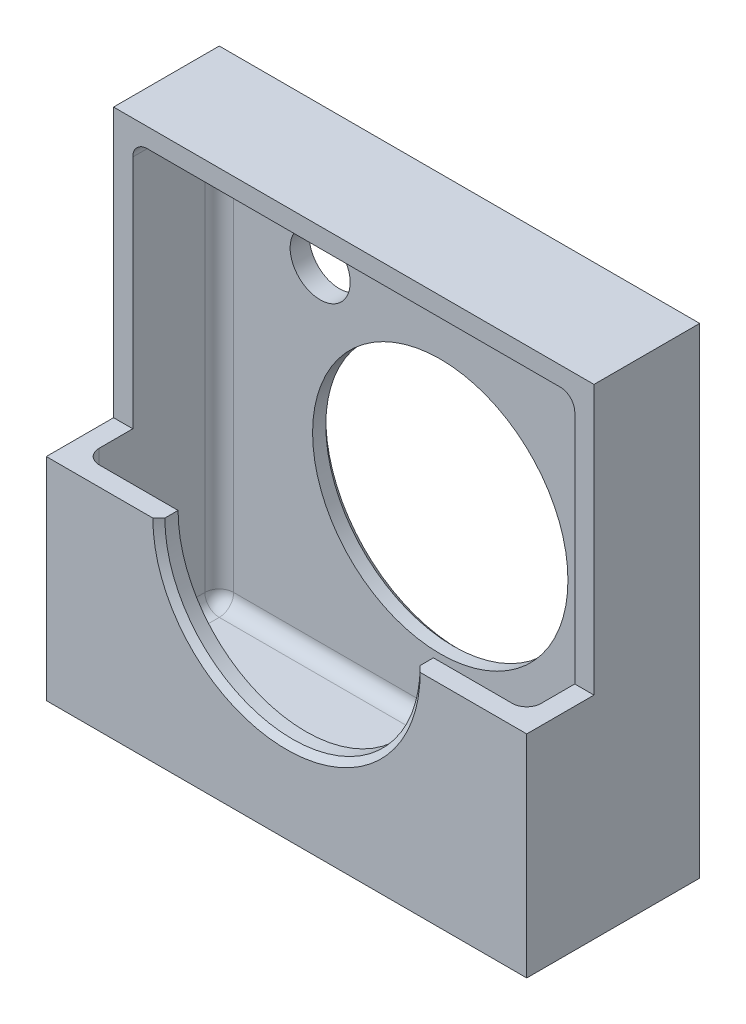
ISO-10303-21;
HEADER;
FILE_DESCRIPTION(('STEP AP214'),'2;1');
FILE_NAME('part.step','',(''),(''),'','','');
FILE_SCHEMA(('AUTOMOTIVE_DESIGN { 1 0 10303 214 1 1 1 1 }'));
ENDSEC;
DATA;
#1=APPLICATION_CONTEXT('core data for automotive mechanical design processes');
#2=APPLICATION_PROTOCOL_DEFINITION('international standard','automotive_design',2000,#1);
#3=PRODUCT_CONTEXT('',#1,'mechanical');
#4=PRODUCT('Part','Part','',(#3));
#5=PRODUCT_RELATED_PRODUCT_CATEGORY('part','',(#4));
#6=PRODUCT_DEFINITION_FORMATION('','',#4);
#7=PRODUCT_DEFINITION_CONTEXT('part definition',#1,'design');
#8=PRODUCT_DEFINITION('design','',#6,#7);
#9=PRODUCT_DEFINITION_SHAPE('','',#8);
#10=(LENGTH_UNIT() NAMED_UNIT(*) SI_UNIT(.MILLI.,.METRE.));
#11=(NAMED_UNIT(*) PLANE_ANGLE_UNIT() SI_UNIT($,.RADIAN.));
#12=(NAMED_UNIT(*) SI_UNIT($,.STERADIAN.) SOLID_ANGLE_UNIT());
#13=UNCERTAINTY_MEASURE_WITH_UNIT(LENGTH_MEASURE(1.E-05),#10,'distance_accuracy_value','');
#14=(GEOMETRIC_REPRESENTATION_CONTEXT(3) GLOBAL_UNCERTAINTY_ASSIGNED_CONTEXT((#13)) GLOBAL_UNIT_ASSIGNED_CONTEXT((#10,
#11,#12)) REPRESENTATION_CONTEXT('',''));
#15=CARTESIAN_POINT('',(0.,0.,0.));
#16=DIRECTION('',(0.,0.,1.));
#17=DIRECTION('',(1.,0.,0.));
#18=AXIS2_PLACEMENT_3D('',#15,#16,#17);
#19=CARTESIAN_POINT('',(0.,22.352,11.176));
#20=DIRECTION('',(0.,1.,0.));
#21=DIRECTION('',(0.,0.,1.));
#22=AXIS2_PLACEMENT_3D('',#19,#20,#21);
#23=PLANE('',#22);
#24=DIRECTION('',(0.,0.,-1.));
#25=VECTOR('',#24,1.);
#26=CARTESIAN_POINT('',(38.9001,22.352,18.288));
#27=LINE('',#26,#25);
#28=CARTESIAN_POINT('',(38.9001,22.352,16.256));
#29=VERTEX_POINT('',#28);
#30=CARTESIAN_POINT('',(38.9001,22.352,17.653));
#31=VERTEX_POINT('',#30);
#32=EDGE_CURVE('E247',#29,#31,#27,.F.);
#33=ORIENTED_EDGE('',*,*,#32,.T.);
#34=DIRECTION('',(-0.707106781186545,0.,-0.70710678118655));
#35=VECTOR('',#34,1.);
#36=CARTESIAN_POINT('',(25.4,22.352,4.15289999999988));
#37=LINE('',#36,#35);
#38=CARTESIAN_POINT('',(39.5351,22.352,18.288));
#39=VERTEX_POINT('',#38);
#40=EDGE_CURVE('E428',#31,#39,#37,.F.);
#41=ORIENTED_EDGE('',*,*,#40,.T.);
#42=DIRECTION('',(1.,0.,0.));
#43=VECTOR('',#42,1.);
#44=CARTESIAN_POINT('',(0.,22.352,18.288));
#45=LINE('',#44,#43);
#46=CARTESIAN_POINT('',(50.8,22.352,18.288));
#47=VERTEX_POINT('',#46);
#48=EDGE_CURVE('E276',#39,#47,#45,.T.);
#49=ORIENTED_EDGE('',*,*,#48,.T.);
#50=DIRECTION('',(0.,0.,1.));
#51=VECTOR('',#50,1.);
#52=CARTESIAN_POINT('',(50.8,22.352,11.176));
#53=LINE('',#52,#51);
#54=CARTESIAN_POINT('',(50.8,22.352,11.176));
#55=VERTEX_POINT('',#54);
#56=EDGE_CURVE('E264',#55,#47,#53,.T.);
#57=ORIENTED_EDGE('',*,*,#56,.F.);
#58=DIRECTION('',(1.,0.,0.));
#59=VECTOR('',#58,1.);
#60=CARTESIAN_POINT('',(0.,22.352,11.176));
#61=LINE('',#60,#59);
#62=CARTESIAN_POINT('',(48.768,22.352,11.176));
#63=VERTEX_POINT('',#62);
#64=EDGE_CURVE('E287',#63,#55,#61,.T.);
#65=ORIENTED_EDGE('',*,*,#64,.F.);
#66=DIRECTION('',(0.,0.,1.));
#67=VECTOR('',#66,1.);
#68=CARTESIAN_POINT('',(48.768,22.352,18.288));
#69=LINE('',#68,#67);
#70=CARTESIAN_POINT('',(48.768,22.352,14.732));
#71=VERTEX_POINT('',#70);
#72=EDGE_CURVE('E250',#63,#71,#69,.T.);
#73=ORIENTED_EDGE('',*,*,#72,.T.);
#74=CARTESIAN_POINT('',(47.244,22.352,14.732));
#75=DIRECTION('',(0.,1.,0.));
#76=DIRECTION('',(0.,0.,1.));
#77=AXIS2_PLACEMENT_3D('',#74,#75,#76);
#78=CIRCLE('',#77,1.524);
#79=CARTESIAN_POINT('',(47.244,22.352,16.256));
#80=VERTEX_POINT('',#79);
#81=EDGE_CURVE('E343',#71,#80,#78,.F.);
#82=ORIENTED_EDGE('',*,*,#81,.T.);
#83=DIRECTION('',(1.,0.,0.));
#84=VECTOR('',#83,1.);
#85=CARTESIAN_POINT('',(0.,22.352,16.256));
#86=LINE('',#85,#84);
#87=EDGE_CURVE('E255',#29,#80,#86,.T.);
#88=ORIENTED_EDGE('',*,*,#87,.F.);
#89=EDGE_LOOP('',(#33,#41,#49,#57,#65,#73,#82,#88));
#90=FACE_BOUND('',#89,.T.);
#91=ADVANCED_FACE('F34',(#90),#23,.T.);
#92=CARTESIAN_POINT('',(0.,22.352,18.288));
#93=VERTEX_POINT('',#92);
#94=CARTESIAN_POINT('',(11.2649,22.352,18.288));
#95=VERTEX_POINT('',#94);
#96=EDGE_CURVE('E288',#93,#95,#45,.T.);
#97=ORIENTED_EDGE('',*,*,#96,.T.);
#98=DIRECTION('',(-0.707106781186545,0.,0.70710678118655));
#99=VECTOR('',#98,1.);
#100=CARTESIAN_POINT('',(25.4,22.352,4.15289999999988));
#101=LINE('',#100,#99);
#102=CARTESIAN_POINT('',(11.8999,22.352,17.653));
#103=VERTEX_POINT('',#102);
#104=EDGE_CURVE('E432',#95,#103,#101,.F.);
#105=ORIENTED_EDGE('',*,*,#104,.T.);
#106=DIRECTION('',(0.,0.,-1.));
#107=VECTOR('',#106,1.);
#108=CARTESIAN_POINT('',(11.8999,22.352,18.288));
#109=LINE('',#108,#107);
#110=CARTESIAN_POINT('',(11.8999,22.352,16.256));
#111=VERTEX_POINT('',#110);
#112=EDGE_CURVE('E244',#103,#111,#109,.T.);
#113=ORIENTED_EDGE('',*,*,#112,.T.);
#114=CARTESIAN_POINT('',(3.556,22.352,16.256));
#115=VERTEX_POINT('',#114);
#116=EDGE_CURVE('E251',#115,#111,#86,.T.);
#117=ORIENTED_EDGE('',*,*,#116,.F.);
#118=CARTESIAN_POINT('',(3.556,22.352,14.732));
#119=DIRECTION('',(0.,1.,0.));
#120=DIRECTION('',(0.,0.,1.));
#121=AXIS2_PLACEMENT_3D('',#118,#119,#120);
#122=CIRCLE('',#121,1.524);
#123=CARTESIAN_POINT('',(2.032,22.352,14.732));
#124=VERTEX_POINT('',#123);
#125=EDGE_CURVE('E345',#115,#124,#122,.F.);
#126=ORIENTED_EDGE('',*,*,#125,.T.);
#127=DIRECTION('',(0.,0.,1.));
#128=VECTOR('',#127,1.);
#129=CARTESIAN_POINT('',(2.032,22.352,11.176));
#130=LINE('',#129,#128);
#131=CARTESIAN_POINT('',(2.032,22.352,11.176));
#132=VERTEX_POINT('',#131);
#133=EDGE_CURVE('E261',#132,#124,#130,.T.);
#134=ORIENTED_EDGE('',*,*,#133,.F.);
#135=CARTESIAN_POINT('',(0.,22.352,11.176));
#136=VERTEX_POINT('',#135);
#137=EDGE_CURVE('E284',#136,#132,#61,.T.);
#138=ORIENTED_EDGE('',*,*,#137,.F.);
#139=DIRECTION('',(0.,0.,1.));
#140=VECTOR('',#139,1.);
#141=CARTESIAN_POINT('',(0.,22.352,11.176));
#142=LINE('',#141,#140);
#143=EDGE_CURVE('E270',#136,#93,#142,.T.);
#144=ORIENTED_EDGE('',*,*,#143,.T.);
#145=EDGE_LOOP('',(#97,#105,#113,#117,#126,#134,#138,#144));
#146=FACE_BOUND('',#145,.T.);
#147=ADVANCED_FACE('F463',(#146),#23,.T.);
#148=CARTESIAN_POINT('',(0.,50.8,18.288));
#149=DIRECTION('',(0.,0.,1.));
#150=DIRECTION('',(1.,0.,0.));
#151=AXIS2_PLACEMENT_3D('',#148,#149,#150);
#152=PLANE('',#151);
#153=ORIENTED_EDGE('',*,*,#48,.F.);
#154=CARTESIAN_POINT('',(25.4,22.352,18.288));
#155=DIRECTION('',(0.,0.,1.));
#156=DIRECTION('',(1.,0.,0.));
#157=AXIS2_PLACEMENT_3D('',#154,#155,#156);
#158=CIRCLE('',#157,14.1351);
#159=EDGE_CURVE('E430',#39,#95,#158,.F.);
#160=ORIENTED_EDGE('',*,*,#159,.T.);
#161=ORIENTED_EDGE('',*,*,#96,.F.);
#162=DIRECTION('',(0.,1.,0.));
#163=VECTOR('',#162,1.);
#164=CARTESIAN_POINT('',(0.,0.,18.288));
#165=LINE('',#164,#163);
#166=CARTESIAN_POINT('',(0.,0.,18.288));
#167=VERTEX_POINT('',#166);
#168=EDGE_CURVE('E291',#167,#93,#165,.T.);
#169=ORIENTED_EDGE('',*,*,#168,.F.);
#170=DIRECTION('',(1.,0.,0.));
#171=VECTOR('',#170,1.);
#172=CARTESIAN_POINT('',(0.,0.,18.288));
#173=LINE('',#172,#171);
#174=CARTESIAN_POINT('',(50.8,0.,18.288));
#175=VERTEX_POINT('',#174);
#176=EDGE_CURVE('E297',#167,#175,#173,.T.);
#177=ORIENTED_EDGE('',*,*,#176,.T.);
#178=DIRECTION('',(0.,-1.,0.));
#179=VECTOR('',#178,1.);
#180=CARTESIAN_POINT('',(50.8,50.8,18.288));
#181=LINE('',#180,#179);
#182=EDGE_CURVE('E294',#47,#175,#181,.T.);
#183=ORIENTED_EDGE('',*,*,#182,.F.);
#184=EDGE_LOOP('',(#153,#160,#161,#169,#177,#183));
#185=FACE_BOUND('',#184,.T.);
#186=ADVANCED_FACE('F469',(#185),#152,.T.);
#187=CARTESIAN_POINT('',(0.,50.8,0.));
#188=DIRECTION('',(0.,0.,1.));
#189=DIRECTION('',(1.,0.,0.));
#190=AXIS2_PLACEMENT_3D('',#187,#188,#189);
#191=PLANE('',#190);
#192=DIRECTION('',(0.,-1.,0.));
#193=VECTOR('',#192,1.);
#194=CARTESIAN_POINT('',(11.811,42.545,5.6843418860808E-11));
#195=LINE('',#194,#193);
#196=CARTESIAN_POINT('',(11.811,42.545,5.6843418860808E-11));
#197=VERTEX_POINT('',#196);
#198=CARTESIAN_POINT('',(11.811,41.148,0.));
#199=VERTEX_POINT('',#198);
#200=EDGE_CURVE('E224',#197,#199,#195,.T.);
#201=ORIENTED_EDGE('',*,*,#200,.T.);
#202=CARTESIAN_POINT('',(12.7,38.1,5.6843418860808E-11));
#203=DIRECTION('',(0.,0.,-1.));
#204=DIRECTION('',(-1.,0.,0.));
#205=AXIS2_PLACEMENT_3D('',#202,#203,#204);
#206=CIRCLE('',#205,3.17499999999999);
#207=CARTESIAN_POINT('',(13.589,41.148,5.6843418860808E-11));
#208=VERTEX_POINT('',#207);
#209=EDGE_CURVE('E49',#208,#199,#206,.T.);
#210=ORIENTED_EDGE('',*,*,#209,.F.);
#211=DIRECTION('',(0.,1.,0.));
#212=VECTOR('',#211,1.);
#213=CARTESIAN_POINT('',(13.589,41.148,5.6843418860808E-11));
#214=LINE('',#213,#212);
#215=CARTESIAN_POINT('',(13.589,42.545,5.6843418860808E-11));
#216=VERTEX_POINT('',#215);
#217=EDGE_CURVE('E231',#208,#216,#214,.T.);
#218=ORIENTED_EDGE('',*,*,#217,.T.);
#219=DIRECTION('',(1.,0.,0.));
#220=VECTOR('',#219,1.);
#221=CARTESIAN_POINT('',(11.811,42.545,5.6843418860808E-11));
#222=LINE('',#221,#220);
#223=EDGE_CURVE('E215',#197,#216,#222,.T.);
#224=ORIENTED_EDGE('',*,*,#223,.F.);
#225=EDGE_LOOP('',(#201,#210,#218,#224));
#226=FACE_BOUND('',#225,.T.);
#227=CARTESIAN_POINT('',(25.4,22.352,0.));
#228=DIRECTION('',(0.,0.,1.));
#229=DIRECTION('',(1.,0.,0.));
#230=AXIS2_PLACEMENT_3D('',#227,#228,#229);
#231=CIRCLE('',#230,14.1351);
#232=CARTESIAN_POINT('',(39.5351,22.352,0.));
#233=VERTEX_POINT('',#232);
#234=EDGE_CURVE('E434',#233,#233,#231,.T.);
#235=ORIENTED_EDGE('',*,*,#234,.T.);
#236=EDGE_LOOP('',(#235));
#237=FACE_BOUND('',#236,.T.);
#238=DIRECTION('',(0.,1.,0.));
#239=VECTOR('',#238,1.);
#240=CARTESIAN_POINT('',(0.,0.,0.));
#241=LINE('',#240,#239);
#242=CARTESIAN_POINT('',(0.,0.,0.));
#243=VERTEX_POINT('',#242);
#244=CARTESIAN_POINT('',(0.,50.8,0.));
#245=VERTEX_POINT('',#244);
#246=EDGE_CURVE('E283',#243,#245,#241,.T.);
#247=ORIENTED_EDGE('',*,*,#246,.T.);
#248=DIRECTION('',(-1.,0.,0.));
#249=VECTOR('',#248,1.);
#250=CARTESIAN_POINT('',(50.8,50.8,0.));
#251=LINE('',#250,#249);
#252=CARTESIAN_POINT('',(50.8,50.8,0.));
#253=VERTEX_POINT('',#252);
#254=EDGE_CURVE('E303',#253,#245,#251,.T.);
#255=ORIENTED_EDGE('',*,*,#254,.F.);
#256=DIRECTION('',(0.,-1.,0.));
#257=VECTOR('',#256,1.);
#258=CARTESIAN_POINT('',(50.8,50.8,0.));
#259=LINE('',#258,#257);
#260=CARTESIAN_POINT('',(50.8,0.,0.));
#261=VERTEX_POINT('',#260);
#262=EDGE_CURVE('E306',#253,#261,#259,.T.);
#263=ORIENTED_EDGE('',*,*,#262,.T.);
#264=DIRECTION('',(1.,0.,0.));
#265=VECTOR('',#264,1.);
#266=CARTESIAN_POINT('',(0.,0.,0.));
#267=LINE('',#266,#265);
#268=EDGE_CURVE('E295',#243,#261,#267,.T.);
#269=ORIENTED_EDGE('',*,*,#268,.F.);
#270=EDGE_LOOP('',(#247,#255,#263,#269));
#271=FACE_BOUND('',#270,.T.);
#272=ADVANCED_FACE('F228',(#226,#237,#271),#191,.F.);
#273=CARTESIAN_POINT('',(0.,50.8,16.256));
#274=DIRECTION('',(0.,0.,1.));
#275=DIRECTION('',(1.,0.,0.));
#276=AXIS2_PLACEMENT_3D('',#273,#274,#275);
#277=PLANE('',#276);
#278=DIRECTION('',(0.,-1.,0.));
#279=VECTOR('',#278,1.);
#280=CARTESIAN_POINT('',(47.244,2.032,16.256));
#281=LINE('',#280,#279);
#282=CARTESIAN_POINT('',(47.244,3.556,16.256));
#283=VERTEX_POINT('',#282);
#284=EDGE_CURVE('E323',#80,#283,#281,.T.);
#285=ORIENTED_EDGE('',*,*,#284,.T.);
#286=DIRECTION('',(1.,0.,0.));
#287=VECTOR('',#286,1.);
#288=CARTESIAN_POINT('',(0.,3.556,16.256));
#289=LINE('',#288,#287);
#290=CARTESIAN_POINT('',(3.556,3.556,16.256));
#291=VERTEX_POINT('',#290);
#292=EDGE_CURVE('E388',#283,#291,#289,.F.);
#293=ORIENTED_EDGE('',*,*,#292,.T.);
#294=DIRECTION('',(0.,1.,0.));
#295=VECTOR('',#294,1.);
#296=CARTESIAN_POINT('',(3.556,22.352,16.256));
#297=LINE('',#296,#295);
#298=EDGE_CURVE('E313',#291,#115,#297,.T.);
#299=ORIENTED_EDGE('',*,*,#298,.T.);
#300=ORIENTED_EDGE('',*,*,#116,.T.);
#301=CARTESIAN_POINT('',(25.4,22.352,16.256));
#302=DIRECTION('',(0.,0.,1.));
#303=DIRECTION('',(1.,0.,0.));
#304=AXIS2_PLACEMENT_3D('',#301,#302,#303);
#305=CIRCLE('',#304,13.5001);
#306=EDGE_CURVE('E241',#29,#111,#305,.F.);
#307=ORIENTED_EDGE('',*,*,#306,.F.);
#308=ORIENTED_EDGE('',*,*,#87,.T.);
#309=EDGE_LOOP('',(#285,#293,#299,#300,#307,#308));
#310=FACE_BOUND('',#309,.T.);
#311=ADVANCED_FACE('F480',(#310),#277,.F.);
#312=CARTESIAN_POINT('',(0.,50.8,2.032));
#313=DIRECTION('',(0.,0.,1.));
#314=DIRECTION('',(1.,0.,0.));
#315=AXIS2_PLACEMENT_3D('',#312,#313,#314);
#316=PLANE('',#315);
#317=CARTESIAN_POINT('',(12.7,38.1,2.032));
#318=DIRECTION('',(0.,0.,1.));
#319=DIRECTION('',(1.,0.,0.));
#320=AXIS2_PLACEMENT_3D('',#317,#318,#319);
#321=CIRCLE('',#320,3.17499999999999);
#322=CARTESIAN_POINT('',(11.811,41.148,2.032));
#323=VERTEX_POINT('',#322);
#324=CARTESIAN_POINT('',(13.589,41.148,2.032));
#325=VERTEX_POINT('',#324);
#326=EDGE_CURVE('E11',#323,#325,#321,.T.);
#327=ORIENTED_EDGE('',*,*,#326,.F.);
#328=DIRECTION('',(0.,1.,0.));
#329=VECTOR('',#328,1.);
#330=CARTESIAN_POINT('',(11.811,50.8,2.032));
#331=LINE('',#330,#329);
#332=CARTESIAN_POINT('',(11.811,42.545,2.032));
#333=VERTEX_POINT('',#332);
#334=EDGE_CURVE('E440',#323,#333,#331,.T.);
#335=ORIENTED_EDGE('',*,*,#334,.T.);
#336=DIRECTION('',(-1.,0.,0.));
#337=VECTOR('',#336,1.);
#338=CARTESIAN_POINT('',(0.,42.545,2.032));
#339=LINE('',#338,#337);
#340=CARTESIAN_POINT('',(13.589,42.545,2.032));
#341=VERTEX_POINT('',#340);
#342=EDGE_CURVE('E218',#341,#333,#339,.T.);
#343=ORIENTED_EDGE('',*,*,#342,.F.);
#344=DIRECTION('',(0.,-1.,0.));
#345=VECTOR('',#344,1.);
#346=CARTESIAN_POINT('',(13.589,50.8,2.032));
#347=LINE('',#346,#345);
#348=EDGE_CURVE('E42',#341,#325,#347,.T.);
#349=ORIENTED_EDGE('',*,*,#348,.T.);
#350=EDGE_LOOP('',(#327,#335,#343,#349));
#351=FACE_BOUND('',#350,.T.);
#352=DIRECTION('',(0.,1.,0.));
#353=VECTOR('',#352,1.);
#354=CARTESIAN_POINT('',(3.55600000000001,50.8,2.032));
#355=LINE('',#354,#353);
#356=CARTESIAN_POINT('',(3.55600000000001,47.244,2.032));
#357=VERTEX_POINT('',#356);
#358=CARTESIAN_POINT('',(3.556,3.556,2.032));
#359=VERTEX_POINT('',#358);
#360=EDGE_CURVE('E331',#357,#359,#355,.F.);
#361=ORIENTED_EDGE('',*,*,#360,.T.);
#362=DIRECTION('',(1.,0.,0.));
#363=VECTOR('',#362,1.);
#364=CARTESIAN_POINT('',(47.244,3.556,2.032));
#365=LINE('',#364,#363);
#366=CARTESIAN_POINT('',(47.244,3.556,2.032));
#367=VERTEX_POINT('',#366);
#368=EDGE_CURVE('E349',#359,#367,#365,.T.);
#369=ORIENTED_EDGE('',*,*,#368,.T.);
#370=DIRECTION('',(0.,-1.,0.));
#371=VECTOR('',#370,1.);
#372=CARTESIAN_POINT('',(47.244,50.8,2.032));
#373=LINE('',#372,#371);
#374=CARTESIAN_POINT('',(47.244,47.244,2.032));
#375=VERTEX_POINT('',#374);
#376=EDGE_CURVE('E334',#367,#375,#373,.F.);
#377=ORIENTED_EDGE('',*,*,#376,.T.);
#378=DIRECTION('',(-1.,0.,0.));
#379=VECTOR('',#378,1.);
#380=CARTESIAN_POINT('',(3.55600000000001,47.244,2.032));
#381=LINE('',#380,#379);
#382=EDGE_CURVE('E347',#375,#357,#381,.T.);
#383=ORIENTED_EDGE('',*,*,#382,.T.);
#384=EDGE_LOOP('',(#361,#369,#377,#383));
#385=FACE_BOUND('',#384,.T.);
#386=CARTESIAN_POINT('',(25.4,22.352,2.032));
#387=DIRECTION('',(0.,0.,1.));
#388=DIRECTION('',(1.,0.,0.));
#389=AXIS2_PLACEMENT_3D('',#386,#387,#388);
#390=CIRCLE('',#389,13.5001);
#391=CARTESIAN_POINT('',(38.9001,22.352,2.032));
#392=VERTEX_POINT('',#391);
#393=EDGE_CURVE('E245',#392,#392,#390,.F.);
#394=ORIENTED_EDGE('',*,*,#393,.T.);
#395=EDGE_LOOP('',(#394));
#396=FACE_BOUND('',#395,.T.);
#397=ADVANCED_FACE('F445',(#351,#385,#396),#316,.T.);
#398=CARTESIAN_POINT('',(0.,22.352,11.176));
#399=DIRECTION('',(0.,0.,-1.));
#400=DIRECTION('',(-1.,0.,0.));
#401=AXIS2_PLACEMENT_3D('',#398,#399,#400);
#402=PLANE('',#401);
#403=DIRECTION('',(0.,1.,0.));
#404=VECTOR('',#403,1.);
#405=CARTESIAN_POINT('',(48.768,50.8,11.176));
#406=LINE('',#405,#404);
#407=CARTESIAN_POINT('',(48.768,47.244,11.176));
#408=VERTEX_POINT('',#407);
#409=EDGE_CURVE('E258',#63,#408,#406,.T.);
#410=ORIENTED_EDGE('',*,*,#409,.F.);
#411=ORIENTED_EDGE('',*,*,#64,.T.);
#412=DIRECTION('',(0.,1.,0.));
#413=VECTOR('',#412,1.);
#414=CARTESIAN_POINT('',(50.8,22.352,11.176));
#415=LINE('',#414,#413);
#416=CARTESIAN_POINT('',(50.8,50.8,11.176));
#417=VERTEX_POINT('',#416);
#418=EDGE_CURVE('E273',#55,#417,#415,.T.);
#419=ORIENTED_EDGE('',*,*,#418,.T.);
#420=DIRECTION('',(1.,0.,0.));
#421=VECTOR('',#420,1.);
#422=CARTESIAN_POINT('',(0.,50.8,11.176));
#423=LINE('',#422,#421);
#424=CARTESIAN_POINT('',(0.,50.8,11.176));
#425=VERTEX_POINT('',#424);
#426=EDGE_CURVE('E280',#425,#417,#423,.T.);
#427=ORIENTED_EDGE('',*,*,#426,.F.);
#428=DIRECTION('',(0.,1.,0.));
#429=VECTOR('',#428,1.);
#430=CARTESIAN_POINT('',(0.,22.352,11.176));
#431=LINE('',#430,#429);
#432=EDGE_CURVE('E272',#136,#425,#431,.T.);
#433=ORIENTED_EDGE('',*,*,#432,.F.);
#434=ORIENTED_EDGE('',*,*,#137,.T.);
#435=DIRECTION('',(0.,1.,0.));
#436=VECTOR('',#435,1.);
#437=CARTESIAN_POINT('',(2.032,22.352,11.176));
#438=LINE('',#437,#436);
#439=CARTESIAN_POINT('',(2.03200000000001,47.244,11.176));
#440=VERTEX_POINT('',#439);
#441=EDGE_CURVE('E265',#132,#440,#438,.T.);
#442=ORIENTED_EDGE('',*,*,#441,.T.);
#443=CARTESIAN_POINT('',(3.55600000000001,47.244,11.176));
#444=DIRECTION('',(0.,0.,-1.));
#445=DIRECTION('',(-1.,0.,0.));
#446=AXIS2_PLACEMENT_3D('',#443,#444,#445);
#447=CIRCLE('',#446,1.524);
#448=CARTESIAN_POINT('',(3.55600000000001,48.768,11.176));
#449=VERTEX_POINT('',#448);
#450=EDGE_CURVE('E392',#440,#449,#447,.T.);
#451=ORIENTED_EDGE('',*,*,#450,.T.);
#452=DIRECTION('',(1.,0.,0.));
#453=VECTOR('',#452,1.);
#454=CARTESIAN_POINT('',(50.8,48.768,11.176));
#455=LINE('',#454,#453);
#456=CARTESIAN_POINT('',(47.244,48.768,11.176));
#457=VERTEX_POINT('',#456);
#458=EDGE_CURVE('E254',#449,#457,#455,.T.);
#459=ORIENTED_EDGE('',*,*,#458,.T.);
#460=CARTESIAN_POINT('',(47.244,47.244,11.176));
#461=DIRECTION('',(0.,0.,-1.));
#462=DIRECTION('',(-1.,0.,0.));
#463=AXIS2_PLACEMENT_3D('',#460,#461,#462);
#464=CIRCLE('',#463,1.524);
#465=EDGE_CURVE('E390',#457,#408,#464,.T.);
#466=ORIENTED_EDGE('',*,*,#465,.T.);
#467=EDGE_LOOP('',(#410,#411,#419,#427,#433,#434,#442,#451,#459,#466));
#468=FACE_BOUND('',#467,.T.);
#469=ADVANCED_FACE('F473',(#468),#402,.F.);
#470=CARTESIAN_POINT('',(0.,0.,18.288));
#471=DIRECTION('',(-1.,0.,0.));
#472=DIRECTION('',(0.,-1.,0.));
#473=AXIS2_PLACEMENT_3D('',#470,#471,#472);
#474=PLANE('',#473);
#475=ORIENTED_EDGE('',*,*,#432,.T.);
#476=DIRECTION('',(0.,0.,-1.));
#477=VECTOR('',#476,1.);
#478=CARTESIAN_POINT('',(0.,50.8,18.288));
#479=LINE('',#478,#477);
#480=EDGE_CURVE('E300',#425,#245,#479,.T.);
#481=ORIENTED_EDGE('',*,*,#480,.T.);
#482=ORIENTED_EDGE('',*,*,#246,.F.);
#483=DIRECTION('',(0.,0.,-1.));
#484=VECTOR('',#483,1.);
#485=CARTESIAN_POINT('',(0.,0.,18.288));
#486=LINE('',#485,#484);
#487=EDGE_CURVE('E311',#167,#243,#486,.T.);
#488=ORIENTED_EDGE('',*,*,#487,.F.);
#489=ORIENTED_EDGE('',*,*,#168,.T.);
#490=ORIENTED_EDGE('',*,*,#143,.F.);
#491=EDGE_LOOP('',(#475,#481,#482,#488,#489,#490));
#492=FACE_BOUND('',#491,.T.);
#493=ADVANCED_FACE('F485',(#492),#474,.T.);
#494=CARTESIAN_POINT('',(0.,0.,18.288));
#495=DIRECTION('',(0.,1.,0.));
#496=DIRECTION('',(0.,0.,1.));
#497=AXIS2_PLACEMENT_3D('',#494,#495,#496);
#498=PLANE('',#497);
#499=ORIENTED_EDGE('',*,*,#268,.T.);
#500=DIRECTION('',(0.,0.,-1.));
#501=VECTOR('',#500,1.);
#502=CARTESIAN_POINT('',(50.8,0.,18.288));
#503=LINE('',#502,#501);
#504=EDGE_CURVE('E314',#175,#261,#503,.T.);
#505=ORIENTED_EDGE('',*,*,#504,.F.);
#506=ORIENTED_EDGE('',*,*,#176,.F.);
#507=ORIENTED_EDGE('',*,*,#487,.T.);
#508=EDGE_LOOP('',(#499,#505,#506,#507));
#509=FACE_BOUND('',#508,.T.);
#510=ADVANCED_FACE('F481',(#509),#498,.F.);
#511=CARTESIAN_POINT('',(50.8,50.8,18.288));
#512=DIRECTION('',(1.,0.,0.));
#513=DIRECTION('',(0.,1.,0.));
#514=AXIS2_PLACEMENT_3D('',#511,#512,#513);
#515=PLANE('',#514);
#516=ORIENTED_EDGE('',*,*,#418,.F.);
#517=ORIENTED_EDGE('',*,*,#56,.T.);
#518=ORIENTED_EDGE('',*,*,#182,.T.);
#519=ORIENTED_EDGE('',*,*,#504,.T.);
#520=ORIENTED_EDGE('',*,*,#262,.F.);
#521=DIRECTION('',(0.,0.,-1.));
#522=VECTOR('',#521,1.);
#523=CARTESIAN_POINT('',(50.8,50.8,18.288));
#524=LINE('',#523,#522);
#525=EDGE_CURVE('E316',#417,#253,#524,.T.);
#526=ORIENTED_EDGE('',*,*,#525,.F.);
#527=EDGE_LOOP('',(#516,#517,#518,#519,#520,#526));
#528=FACE_BOUND('',#527,.T.);
#529=ADVANCED_FACE('F484',(#528),#515,.T.);
#530=CARTESIAN_POINT('',(50.8,50.8,18.288));
#531=DIRECTION('',(0.,-1.,0.));
#532=DIRECTION('',(0.,0.,-1.));
#533=AXIS2_PLACEMENT_3D('',#530,#531,#532);
#534=PLANE('',#533);
#535=ORIENTED_EDGE('',*,*,#480,.F.);
#536=ORIENTED_EDGE('',*,*,#426,.T.);
#537=ORIENTED_EDGE('',*,*,#525,.T.);
#538=ORIENTED_EDGE('',*,*,#254,.T.);
#539=EDGE_LOOP('',(#535,#536,#537,#538));
#540=FACE_BOUND('',#539,.T.);
#541=ADVANCED_FACE('F489',(#540),#534,.F.);
#542=CARTESIAN_POINT('',(2.032,0.,18.288));
#543=DIRECTION('',(-1.,0.,0.));
#544=DIRECTION('',(0.,-1.,0.));
#545=AXIS2_PLACEMENT_3D('',#542,#543,#544);
#546=PLANE('',#545);
#547=DIRECTION('',(0.,1.,0.));
#548=VECTOR('',#547,1.);
#549=CARTESIAN_POINT('',(2.032,0.,3.556));
#550=LINE('',#549,#548);
#551=CARTESIAN_POINT('',(2.032,3.556,3.556));
#552=VERTEX_POINT('',#551);
#553=CARTESIAN_POINT('',(2.03200000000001,47.244,3.556));
#554=VERTEX_POINT('',#553);
#555=EDGE_CURVE('E340',#552,#554,#550,.T.);
#556=ORIENTED_EDGE('',*,*,#555,.T.);
#557=DIRECTION('',(0.,0.,-1.));
#558=VECTOR('',#557,1.);
#559=CARTESIAN_POINT('',(2.03200000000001,47.244,18.288));
#560=LINE('',#559,#558);
#561=EDGE_CURVE('E382',#554,#440,#560,.F.);
#562=ORIENTED_EDGE('',*,*,#561,.T.);
#563=ORIENTED_EDGE('',*,*,#441,.F.);
#564=ORIENTED_EDGE('',*,*,#133,.T.);
#565=DIRECTION('',(0.,1.,0.));
#566=VECTOR('',#565,1.);
#567=CARTESIAN_POINT('',(2.032,2.032,14.732));
#568=LINE('',#567,#566);
#569=CARTESIAN_POINT('',(2.032,3.556,14.732));
#570=VERTEX_POINT('',#569);
#571=EDGE_CURVE('E337',#124,#570,#568,.F.);
#572=ORIENTED_EDGE('',*,*,#571,.T.);
#573=DIRECTION('',(0.,0.,-1.));
#574=VECTOR('',#573,1.);
#575=CARTESIAN_POINT('',(2.032,3.556,18.288));
#576=LINE('',#575,#574);
#577=EDGE_CURVE('E380',#570,#552,#576,.T.);
#578=ORIENTED_EDGE('',*,*,#577,.T.);
#579=EDGE_LOOP('',(#556,#562,#563,#564,#572,#578));
#580=FACE_BOUND('',#579,.T.);
#581=ADVANCED_FACE('F493',(#580),#546,.F.);
#582=CARTESIAN_POINT('',(0.,2.032,18.288));
#583=DIRECTION('',(0.,1.,0.));
#584=DIRECTION('',(0.,0.,1.));
#585=AXIS2_PLACEMENT_3D('',#582,#583,#584);
#586=PLANE('',#585);
#587=DIRECTION('',(0.,0.,-1.));
#588=VECTOR('',#587,1.);
#589=CARTESIAN_POINT('',(47.244,2.032,18.288));
#590=LINE('',#589,#588);
#591=CARTESIAN_POINT('',(47.244,2.032,14.732));
#592=VERTEX_POINT('',#591);
#593=CARTESIAN_POINT('',(47.244,2.032,3.556));
#594=VERTEX_POINT('',#593);
#595=EDGE_CURVE('E354',#592,#594,#590,.T.);
#596=ORIENTED_EDGE('',*,*,#595,.T.);
#597=DIRECTION('',(1.,0.,0.));
#598=VECTOR('',#597,1.);
#599=CARTESIAN_POINT('',(3.556,2.032,3.556));
#600=LINE('',#599,#598);
#601=CARTESIAN_POINT('',(3.556,2.032,3.556));
#602=VERTEX_POINT('',#601);
#603=EDGE_CURVE('E358',#594,#602,#600,.F.);
#604=ORIENTED_EDGE('',*,*,#603,.T.);
#605=DIRECTION('',(0.,0.,-1.));
#606=VECTOR('',#605,1.);
#607=CARTESIAN_POINT('',(3.556,2.032,18.288));
#608=LINE('',#607,#606);
#609=CARTESIAN_POINT('',(3.556,2.032,14.732));
#610=VERTEX_POINT('',#609);
#611=EDGE_CURVE('E356',#602,#610,#608,.F.);
#612=ORIENTED_EDGE('',*,*,#611,.T.);
#613=DIRECTION('',(1.,0.,0.));
#614=VECTOR('',#613,1.);
#615=CARTESIAN_POINT('',(0.,2.032,14.732));
#616=LINE('',#615,#614);
#617=EDGE_CURVE('E352',#610,#592,#616,.T.);
#618=ORIENTED_EDGE('',*,*,#617,.T.);
#619=EDGE_LOOP('',(#596,#604,#612,#618));
#620=FACE_BOUND('',#619,.T.);
#621=ADVANCED_FACE('F598',(#620),#586,.T.);
#622=CARTESIAN_POINT('',(48.768,50.8,18.288));
#623=DIRECTION('',(1.,0.,0.));
#624=DIRECTION('',(0.,1.,0.));
#625=AXIS2_PLACEMENT_3D('',#622,#623,#624);
#626=PLANE('',#625);
#627=ORIENTED_EDGE('',*,*,#409,.T.);
#628=DIRECTION('',(0.,0.,-1.));
#629=VECTOR('',#628,1.);
#630=CARTESIAN_POINT('',(48.768,47.244,18.288));
#631=LINE('',#630,#629);
#632=CARTESIAN_POINT('',(48.768,47.244,3.556));
#633=VERTEX_POINT('',#632);
#634=EDGE_CURVE('E371',#408,#633,#631,.T.);
#635=ORIENTED_EDGE('',*,*,#634,.T.);
#636=DIRECTION('',(0.,-1.,0.));
#637=VECTOR('',#636,1.);
#638=CARTESIAN_POINT('',(48.768,50.8,3.556));
#639=LINE('',#638,#637);
#640=CARTESIAN_POINT('',(48.768,3.556,3.556));
#641=VERTEX_POINT('',#640);
#642=EDGE_CURVE('E326',#633,#641,#639,.T.);
#643=ORIENTED_EDGE('',*,*,#642,.T.);
#644=DIRECTION('',(0.,0.,-1.));
#645=VECTOR('',#644,1.);
#646=CARTESIAN_POINT('',(48.768,3.556,18.288));
#647=LINE('',#646,#645);
#648=CARTESIAN_POINT('',(48.768,3.556,14.732));
#649=VERTEX_POINT('',#648);
#650=EDGE_CURVE('E369',#641,#649,#647,.F.);
#651=ORIENTED_EDGE('',*,*,#650,.T.);
#652=DIRECTION('',(0.,-1.,0.));
#653=VECTOR('',#652,1.);
#654=CARTESIAN_POINT('',(48.768,22.352,14.732));
#655=LINE('',#654,#653);
#656=EDGE_CURVE('E329',#649,#71,#655,.F.);
#657=ORIENTED_EDGE('',*,*,#656,.T.);
#658=ORIENTED_EDGE('',*,*,#72,.F.);
#659=EDGE_LOOP('',(#627,#635,#643,#651,#657,#658));
#660=FACE_BOUND('',#659,.T.);
#661=ADVANCED_FACE('F641',(#660),#626,.F.);
#662=CARTESIAN_POINT('',(50.8,48.768,18.288));
#663=DIRECTION('',(0.,-1.,0.));
#664=DIRECTION('',(0.,0.,-1.));
#665=AXIS2_PLACEMENT_3D('',#662,#663,#664);
#666=PLANE('',#665);
#667=DIRECTION('',(-1.,0.,0.));
#668=VECTOR('',#667,1.);
#669=CARTESIAN_POINT('',(47.244,48.768,3.556));
#670=LINE('',#669,#668);
#671=CARTESIAN_POINT('',(3.55600000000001,48.768,3.556));
#672=VERTEX_POINT('',#671);
#673=CARTESIAN_POINT('',(47.244,48.768,3.556));
#674=VERTEX_POINT('',#673);
#675=EDGE_CURVE('E374',#672,#674,#670,.F.);
#676=ORIENTED_EDGE('',*,*,#675,.T.);
#677=DIRECTION('',(0.,0.,-1.));
#678=VECTOR('',#677,1.);
#679=CARTESIAN_POINT('',(47.244,48.768,18.288));
#680=LINE('',#679,#678);
#681=EDGE_CURVE('E378',#674,#457,#680,.F.);
#682=ORIENTED_EDGE('',*,*,#681,.T.);
#683=ORIENTED_EDGE('',*,*,#458,.F.);
#684=DIRECTION('',(0.,0.,-1.));
#685=VECTOR('',#684,1.);
#686=CARTESIAN_POINT('',(3.55600000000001,48.768,18.288));
#687=LINE('',#686,#685);
#688=EDGE_CURVE('E376',#449,#672,#687,.T.);
#689=ORIENTED_EDGE('',*,*,#688,.T.);
#690=EDGE_LOOP('',(#676,#682,#683,#689));
#691=FACE_BOUND('',#690,.T.);
#692=ADVANCED_FACE('F617',(#691),#666,.T.);
#693=CARTESIAN_POINT('',(25.4,22.352,18.288));
#694=DIRECTION('',(0.,0.,-1.));
#695=DIRECTION('',(-1.,0.,0.));
#696=AXIS2_PLACEMENT_3D('',#693,#694,#695);
#697=CYLINDRICAL_SURFACE('',#696,13.5001);
#698=CARTESIAN_POINT('',(25.4,22.352,0.635000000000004));
#699=DIRECTION('',(0.,0.,1.));
#700=DIRECTION('',(1.,0.,0.));
#701=AXIS2_PLACEMENT_3D('',#698,#699,#700);
#702=CIRCLE('',#701,13.5001);
#703=CARTESIAN_POINT('',(38.9001,22.352,0.635000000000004));
#704=VERTEX_POINT('',#703);
#705=EDGE_CURVE('E437',#704,#704,#702,.F.);
#706=ORIENTED_EDGE('',*,*,#705,.T.);
#707=EDGE_LOOP('',(#706));
#708=FACE_BOUND('',#707,.T.);
#709=ORIENTED_EDGE('',*,*,#393,.F.);
#710=EDGE_LOOP('',(#709));
#711=FACE_BOUND('',#710,.T.);
#712=ADVANCED_FACE('F654',(#708,#711),#697,.F.);
#713=ORIENTED_EDGE('',*,*,#112,.F.);
#714=CARTESIAN_POINT('',(25.4,22.352,17.653));
#715=DIRECTION('',(0.,0.,1.));
#716=DIRECTION('',(1.,0.,0.));
#717=AXIS2_PLACEMENT_3D('',#714,#715,#716);
#718=CIRCLE('',#717,13.5001);
#719=EDGE_CURVE('E394',#103,#31,#718,.T.);
#720=ORIENTED_EDGE('',*,*,#719,.T.);
#721=ORIENTED_EDGE('',*,*,#32,.F.);
#722=ORIENTED_EDGE('',*,*,#306,.T.);
#723=EDGE_LOOP('',(#713,#720,#721,#722));
#724=FACE_BOUND('',#723,.T.);
#725=ADVANCED_FACE('F502',(#724),#697,.F.);
#726=CARTESIAN_POINT('',(47.244,50.8,14.732));
#727=DIRECTION('',(0.,1.,0.));
#728=DIRECTION('',(-1.,0.,0.));
#729=AXIS2_PLACEMENT_3D('',#726,#727,#728);
#730=CYLINDRICAL_SURFACE('',#729,1.524);
#731=ORIENTED_EDGE('',*,*,#656,.F.);
#732=CARTESIAN_POINT('',(47.244,3.556,14.732));
#733=DIRECTION('',(0.,1.,0.));
#734=DIRECTION('',(-1.,0.,0.));
#735=AXIS2_PLACEMENT_3D('',#732,#733,#734);
#736=CIRCLE('',#735,1.524);
#737=EDGE_CURVE('E386',#649,#283,#736,.F.);
#738=ORIENTED_EDGE('',*,*,#737,.T.);
#739=ORIENTED_EDGE('',*,*,#284,.F.);
#740=ORIENTED_EDGE('',*,*,#81,.F.);
#741=EDGE_LOOP('',(#731,#738,#739,#740));
#742=FACE_BOUND('',#741,.T.);
#743=ADVANCED_FACE('F498',(#742),#730,.F.);
#744=CARTESIAN_POINT('',(47.244,50.8,3.556));
#745=DIRECTION('',(0.,-1.,0.));
#746=DIRECTION('',(1.,0.,0.));
#747=AXIS2_PLACEMENT_3D('',#744,#745,#746);
#748=CYLINDRICAL_SURFACE('',#747,1.524);
#749=ORIENTED_EDGE('',*,*,#376,.F.);
#750=CARTESIAN_POINT('',(47.244,3.556,3.556));
#751=DIRECTION('',(0.,-1.,0.));
#752=DIRECTION('',(1.,0.,0.));
#753=AXIS2_PLACEMENT_3D('',#750,#751,#752);
#754=CIRCLE('',#753,1.524);
#755=EDGE_CURVE('E367',#367,#641,#754,.T.);
#756=ORIENTED_EDGE('',*,*,#755,.T.);
#757=ORIENTED_EDGE('',*,*,#642,.F.);
#758=CARTESIAN_POINT('',(47.244,47.244,3.556));
#759=DIRECTION('',(0.,-1.,0.));
#760=DIRECTION('',(1.,0.,0.));
#761=AXIS2_PLACEMENT_3D('',#758,#759,#760);
#762=CIRCLE('',#761,1.524);
#763=EDGE_CURVE('E365',#633,#375,#762,.F.);
#764=ORIENTED_EDGE('',*,*,#763,.T.);
#765=EDGE_LOOP('',(#749,#756,#757,#764));
#766=FACE_BOUND('',#765,.T.);
#767=ADVANCED_FACE('F501',(#766),#748,.F.);
#768=CARTESIAN_POINT('',(3.556,0.,3.556));
#769=DIRECTION('',(0.,1.,0.));
#770=DIRECTION('',(-1.,0.,0.));
#771=AXIS2_PLACEMENT_3D('',#768,#769,#770);
#772=CYLINDRICAL_SURFACE('',#771,1.524);
#773=ORIENTED_EDGE('',*,*,#555,.F.);
#774=CARTESIAN_POINT('',(3.556,3.556,3.556));
#775=DIRECTION('',(0.,1.,0.));
#776=DIRECTION('',(-1.,0.,0.));
#777=AXIS2_PLACEMENT_3D('',#774,#775,#776);
#778=CIRCLE('',#777,1.524);
#779=EDGE_CURVE('E363',#552,#359,#778,.F.);
#780=ORIENTED_EDGE('',*,*,#779,.T.);
#781=ORIENTED_EDGE('',*,*,#360,.F.);
#782=CARTESIAN_POINT('',(3.55600000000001,47.244,3.556));
#783=DIRECTION('',(0.,1.,0.));
#784=DIRECTION('',(-1.,0.,0.));
#785=AXIS2_PLACEMENT_3D('',#782,#783,#784);
#786=CIRCLE('',#785,1.524);
#787=EDGE_CURVE('E361',#357,#554,#786,.T.);
#788=ORIENTED_EDGE('',*,*,#787,.T.);
#789=EDGE_LOOP('',(#773,#780,#781,#788));
#790=FACE_BOUND('',#789,.T.);
#791=ADVANCED_FACE('F506',(#790),#772,.F.);
#792=CARTESIAN_POINT('',(3.55600000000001,50.8,14.732));
#793=DIRECTION('',(0.,-1.,0.));
#794=DIRECTION('',(1.,0.,0.));
#795=AXIS2_PLACEMENT_3D('',#792,#793,#794);
#796=CYLINDRICAL_SURFACE('',#795,1.524);
#797=ORIENTED_EDGE('',*,*,#298,.F.);
#798=CARTESIAN_POINT('',(3.556,3.556,14.732));
#799=DIRECTION('',(0.,-1.,0.));
#800=DIRECTION('',(1.,0.,0.));
#801=AXIS2_PLACEMENT_3D('',#798,#799,#800);
#802=CIRCLE('',#801,1.524);
#803=EDGE_CURVE('E384',#291,#570,#802,.T.);
#804=ORIENTED_EDGE('',*,*,#803,.T.);
#805=ORIENTED_EDGE('',*,*,#571,.F.);
#806=ORIENTED_EDGE('',*,*,#125,.F.);
#807=EDGE_LOOP('',(#797,#804,#805,#806));
#808=FACE_BOUND('',#807,.T.);
#809=ADVANCED_FACE('F510',(#808),#796,.F.);
#810=CARTESIAN_POINT('',(0.,3.556,14.732));
#811=DIRECTION('',(1.,0.,0.));
#812=DIRECTION('',(0.,0.,-1.));
#813=AXIS2_PLACEMENT_3D('',#810,#811,#812);
#814=CYLINDRICAL_SURFACE('',#813,1.524);
#815=CARTESIAN_POINT('',(3.556,3.556,14.732));
#816=DIRECTION('',(1.,0.,0.));
#817=DIRECTION('',(0.,0.,-1.));
#818=AXIS2_PLACEMENT_3D('',#815,#816,#817);
#819=CIRCLE('',#818,1.524);
#820=EDGE_CURVE('E321',#291,#610,#819,.T.);
#821=ORIENTED_EDGE('',*,*,#820,.F.);
#822=ORIENTED_EDGE('',*,*,#292,.F.);
#823=CARTESIAN_POINT('',(47.244,3.556,14.732));
#824=DIRECTION('',(-1.,0.,0.));
#825=DIRECTION('',(0.,0.,1.));
#826=AXIS2_PLACEMENT_3D('',#823,#824,#825);
#827=CIRCLE('',#826,1.524);
#828=EDGE_CURVE('E412',#592,#283,#827,.T.);
#829=ORIENTED_EDGE('',*,*,#828,.F.);
#830=ORIENTED_EDGE('',*,*,#617,.F.);
#831=EDGE_LOOP('',(#821,#822,#829,#830));
#832=FACE_BOUND('',#831,.T.);
#833=ADVANCED_FACE('F514',(#832),#814,.F.);
#834=CARTESIAN_POINT('',(3.556,3.556,14.732));
#835=DIRECTION('',(0.,0.,1.));
#836=DIRECTION('',(1.,0.,0.));
#837=AXIS2_PLACEMENT_3D('',#834,#835,#836);
#838=SPHERICAL_SURFACE('',#837,1.524);
#839=ORIENTED_EDGE('',*,*,#803,.F.);
#840=ORIENTED_EDGE('',*,*,#820,.T.);
#841=CARTESIAN_POINT('',(3.556,3.556,14.732));
#842=DIRECTION('',(0.,0.,1.));
#843=DIRECTION('',(1.,0.,0.));
#844=AXIS2_PLACEMENT_3D('',#841,#842,#843);
#845=CIRCLE('',#844,1.524);
#846=EDGE_CURVE('E409',#570,#610,#845,.T.);
#847=ORIENTED_EDGE('',*,*,#846,.F.);
#848=EDGE_LOOP('',(#839,#840,#847));
#849=FACE_BOUND('',#848,.T.);
#850=ADVANCED_FACE('F540',(#849),#838,.F.);
#851=CARTESIAN_POINT('',(47.244,3.556,14.732));
#852=DIRECTION('',(0.,0.,1.));
#853=DIRECTION('',(1.,0.,0.));
#854=AXIS2_PLACEMENT_3D('',#851,#852,#853);
#855=SPHERICAL_SURFACE('',#854,1.524);
#856=ORIENTED_EDGE('',*,*,#828,.T.);
#857=ORIENTED_EDGE('',*,*,#737,.F.);
#858=CARTESIAN_POINT('',(47.244,3.556,14.732));
#859=DIRECTION('',(0.,0.,1.));
#860=DIRECTION('',(1.,0.,0.));
#861=AXIS2_PLACEMENT_3D('',#858,#859,#860);
#862=CIRCLE('',#861,1.524);
#863=EDGE_CURVE('E406',#592,#649,#862,.T.);
#864=ORIENTED_EDGE('',*,*,#863,.F.);
#865=EDGE_LOOP('',(#856,#857,#864));
#866=FACE_BOUND('',#865,.T.);
#867=ADVANCED_FACE('F536',(#866),#855,.F.);
#868=CARTESIAN_POINT('',(3.556,3.556,18.288));
#869=DIRECTION('',(0.,0.,-1.));
#870=DIRECTION('',(-1.,0.,0.));
#871=AXIS2_PLACEMENT_3D('',#868,#869,#870);
#872=CYLINDRICAL_SURFACE('',#871,1.524);
#873=ORIENTED_EDGE('',*,*,#846,.T.);
#874=ORIENTED_EDGE('',*,*,#611,.F.);
#875=CARTESIAN_POINT('',(3.556,3.556,3.556));
#876=DIRECTION('',(0.,0.,1.));
#877=DIRECTION('',(1.,0.,0.));
#878=AXIS2_PLACEMENT_3D('',#875,#876,#877);
#879=CIRCLE('',#878,1.524);
#880=EDGE_CURVE('E403',#552,#602,#879,.T.);
#881=ORIENTED_EDGE('',*,*,#880,.F.);
#882=ORIENTED_EDGE('',*,*,#577,.F.);
#883=EDGE_LOOP('',(#873,#874,#881,#882));
#884=FACE_BOUND('',#883,.T.);
#885=ADVANCED_FACE('F532',(#884),#872,.F.);
#886=CARTESIAN_POINT('',(47.244,3.556,18.288));
#887=DIRECTION('',(0.,0.,-1.));
#888=DIRECTION('',(-1.,0.,0.));
#889=AXIS2_PLACEMENT_3D('',#886,#887,#888);
#890=CYLINDRICAL_SURFACE('',#889,1.524);
#891=ORIENTED_EDGE('',*,*,#863,.T.);
#892=ORIENTED_EDGE('',*,*,#650,.F.);
#893=CARTESIAN_POINT('',(47.244,3.556,3.556));
#894=DIRECTION('',(0.,0.,1.));
#895=DIRECTION('',(1.,0.,0.));
#896=AXIS2_PLACEMENT_3D('',#893,#894,#895);
#897=CIRCLE('',#896,1.524);
#898=EDGE_CURVE('E400',#594,#641,#897,.T.);
#899=ORIENTED_EDGE('',*,*,#898,.F.);
#900=ORIENTED_EDGE('',*,*,#595,.F.);
#901=EDGE_LOOP('',(#891,#892,#899,#900));
#902=FACE_BOUND('',#901,.T.);
#903=ADVANCED_FACE('F528',(#902),#890,.F.);
#904=CARTESIAN_POINT('',(3.556,3.556,3.556));
#905=DIRECTION('',(0.,0.,1.));
#906=DIRECTION('',(1.,0.,0.));
#907=AXIS2_PLACEMENT_3D('',#904,#905,#906);
#908=SPHERICAL_SURFACE('',#907,1.524);
#909=ORIENTED_EDGE('',*,*,#779,.F.);
#910=ORIENTED_EDGE('',*,*,#880,.T.);
#911=CARTESIAN_POINT('',(3.556,3.556,3.556));
#912=DIRECTION('',(-1.,0.,0.));
#913=DIRECTION('',(0.,0.,1.));
#914=AXIS2_PLACEMENT_3D('',#911,#912,#913);
#915=CIRCLE('',#914,1.524);
#916=EDGE_CURVE('E397',#359,#602,#915,.T.);
#917=ORIENTED_EDGE('',*,*,#916,.F.);
#918=EDGE_LOOP('',(#909,#910,#917));
#919=FACE_BOUND('',#918,.T.);
#920=ADVANCED_FACE('F524',(#919),#908,.F.);
#921=CARTESIAN_POINT('',(47.244,3.556,3.556));
#922=DIRECTION('',(0.,0.,1.));
#923=DIRECTION('',(1.,0.,0.));
#924=AXIS2_PLACEMENT_3D('',#921,#922,#923);
#925=SPHERICAL_SURFACE('',#924,1.524);
#926=ORIENTED_EDGE('',*,*,#898,.T.);
#927=ORIENTED_EDGE('',*,*,#755,.F.);
#928=CARTESIAN_POINT('',(47.244,3.556,3.556));
#929=DIRECTION('',(1.,0.,0.));
#930=DIRECTION('',(0.,0.,-1.));
#931=AXIS2_PLACEMENT_3D('',#928,#929,#930);
#932=CIRCLE('',#931,1.524);
#933=EDGE_CURVE('E395',#594,#367,#932,.T.);
#934=ORIENTED_EDGE('',*,*,#933,.F.);
#935=EDGE_LOOP('',(#926,#927,#934));
#936=FACE_BOUND('',#935,.T.);
#937=ADVANCED_FACE('F520',(#936),#925,.F.);
#938=CARTESIAN_POINT('',(0.,3.556,3.556));
#939=DIRECTION('',(-1.,0.,0.));
#940=DIRECTION('',(0.,0.,1.));
#941=AXIS2_PLACEMENT_3D('',#938,#939,#940);
#942=CYLINDRICAL_SURFACE('',#941,1.524);
#943=ORIENTED_EDGE('',*,*,#916,.T.);
#944=ORIENTED_EDGE('',*,*,#603,.F.);
#945=ORIENTED_EDGE('',*,*,#933,.T.);
#946=ORIENTED_EDGE('',*,*,#368,.F.);
#947=EDGE_LOOP('',(#943,#944,#945,#946));
#948=FACE_BOUND('',#947,.T.);
#949=ADVANCED_FACE('F516',(#948),#942,.F.);
#950=CARTESIAN_POINT('',(3.55600000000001,47.244,18.288));
#951=DIRECTION('',(0.,0.,-1.));
#952=DIRECTION('',(-1.,0.,0.));
#953=AXIS2_PLACEMENT_3D('',#950,#951,#952);
#954=CYLINDRICAL_SURFACE('',#953,1.524);
#955=ORIENTED_EDGE('',*,*,#450,.F.);
#956=ORIENTED_EDGE('',*,*,#561,.F.);
#957=CARTESIAN_POINT('',(3.55600000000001,47.244,3.556));
#958=DIRECTION('',(0.,0.,1.));
#959=DIRECTION('',(1.,0.,0.));
#960=AXIS2_PLACEMENT_3D('',#957,#958,#959);
#961=CIRCLE('',#960,1.524);
#962=EDGE_CURVE('E398',#672,#554,#961,.T.);
#963=ORIENTED_EDGE('',*,*,#962,.F.);
#964=ORIENTED_EDGE('',*,*,#688,.F.);
#965=EDGE_LOOP('',(#955,#956,#963,#964));
#966=FACE_BOUND('',#965,.T.);
#967=ADVANCED_FACE('F519',(#966),#954,.F.);
#968=CARTESIAN_POINT('',(3.55600000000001,47.244,3.556));
#969=DIRECTION('',(0.,0.,1.));
#970=DIRECTION('',(1.,0.,0.));
#971=AXIS2_PLACEMENT_3D('',#968,#969,#970);
#972=SPHERICAL_SURFACE('',#971,1.524);
#973=ORIENTED_EDGE('',*,*,#962,.T.);
#974=ORIENTED_EDGE('',*,*,#787,.F.);
#975=CARTESIAN_POINT('',(3.55600000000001,47.244,3.556));
#976=DIRECTION('',(-1.,0.,0.));
#977=DIRECTION('',(0.,0.,1.));
#978=AXIS2_PLACEMENT_3D('',#975,#976,#977);
#979=CIRCLE('',#978,1.524);
#980=EDGE_CURVE('E421',#672,#357,#979,.T.);
#981=ORIENTED_EDGE('',*,*,#980,.F.);
#982=EDGE_LOOP('',(#973,#974,#981));
#983=FACE_BOUND('',#982,.T.);
#984=ADVANCED_FACE('F559',(#983),#972,.F.);
#985=CARTESIAN_POINT('',(0.,47.244,3.556));
#986=DIRECTION('',(1.,0.,0.));
#987=DIRECTION('',(0.,0.,-1.));
#988=AXIS2_PLACEMENT_3D('',#985,#986,#987);
#989=CYLINDRICAL_SURFACE('',#988,1.524);
#990=ORIENTED_EDGE('',*,*,#980,.T.);
#991=ORIENTED_EDGE('',*,*,#382,.F.);
#992=CARTESIAN_POINT('',(47.244,47.244,3.556));
#993=DIRECTION('',(-1.,0.,0.));
#994=DIRECTION('',(0.,0.,1.));
#995=AXIS2_PLACEMENT_3D('',#992,#993,#994);
#996=CIRCLE('',#995,1.524);
#997=EDGE_CURVE('E418',#674,#375,#996,.T.);
#998=ORIENTED_EDGE('',*,*,#997,.F.);
#999=ORIENTED_EDGE('',*,*,#675,.F.);
#1000=EDGE_LOOP('',(#990,#991,#998,#999));
#1001=FACE_BOUND('',#1000,.T.);
#1002=ADVANCED_FACE('F555',(#1001),#989,.F.);
#1003=CARTESIAN_POINT('',(47.244,47.244,3.556));
#1004=DIRECTION('',(0.,0.,1.));
#1005=DIRECTION('',(1.,0.,0.));
#1006=AXIS2_PLACEMENT_3D('',#1003,#1004,#1005);
#1007=SPHERICAL_SURFACE('',#1006,1.524);
#1008=ORIENTED_EDGE('',*,*,#997,.T.);
#1009=ORIENTED_EDGE('',*,*,#763,.F.);
#1010=CARTESIAN_POINT('',(47.244,47.244,3.556));
#1011=DIRECTION('',(0.,0.,-1.));
#1012=DIRECTION('',(-1.,0.,0.));
#1013=AXIS2_PLACEMENT_3D('',#1010,#1011,#1012);
#1014=CIRCLE('',#1013,1.524);
#1015=EDGE_CURVE('E238',#674,#633,#1014,.T.);
#1016=ORIENTED_EDGE('',*,*,#1015,.F.);
#1017=EDGE_LOOP('',(#1008,#1009,#1016));
#1018=FACE_BOUND('',#1017,.T.);
#1019=ADVANCED_FACE('F551',(#1018),#1007,.F.);
#1020=CARTESIAN_POINT('',(47.244,47.244,18.288));
#1021=DIRECTION('',(0.,0.,-1.));
#1022=DIRECTION('',(-1.,0.,0.));
#1023=AXIS2_PLACEMENT_3D('',#1020,#1021,#1022);
#1024=CYLINDRICAL_SURFACE('',#1023,1.524);
#1025=ORIENTED_EDGE('',*,*,#465,.F.);
#1026=ORIENTED_EDGE('',*,*,#681,.F.);
#1027=ORIENTED_EDGE('',*,*,#1015,.T.);
#1028=ORIENTED_EDGE('',*,*,#634,.F.);
#1029=EDGE_LOOP('',(#1025,#1026,#1027,#1028));
#1030=FACE_BOUND('',#1029,.T.);
#1031=ADVANCED_FACE('F548',(#1030),#1024,.F.);
#1032=CARTESIAN_POINT('',(25.4,22.352,17.653));
#1033=DIRECTION('',(0.,0.,1.));
#1034=DIRECTION('',(1.,0.,0.));
#1035=AXIS2_PLACEMENT_3D('',#1032,#1033,#1034);
#1036=CONICAL_SURFACE('',#1035,13.5001,0.785398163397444);
#1037=ORIENTED_EDGE('',*,*,#104,.F.);
#1038=ORIENTED_EDGE('',*,*,#159,.F.);
#1039=ORIENTED_EDGE('',*,*,#40,.F.);
#1040=ORIENTED_EDGE('',*,*,#719,.F.);
#1041=EDGE_LOOP('',(#1037,#1038,#1039,#1040));
#1042=FACE_BOUND('',#1041,.T.);
#1043=ADVANCED_FACE('F458',(#1042),#1036,.F.);
#1044=CARTESIAN_POINT('',(25.4,22.352,0.));
#1045=DIRECTION('',(0.,0.,-1.));
#1046=DIRECTION('',(-1.,0.,0.));
#1047=AXIS2_PLACEMENT_3D('',#1044,#1045,#1046);
#1048=CONICAL_SURFACE('',#1047,14.1351,0.785398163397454);
#1049=ORIENTED_EDGE('',*,*,#705,.F.);
#1050=EDGE_LOOP('',(#1049));
#1051=FACE_BOUND('',#1050,.T.);
#1052=ORIENTED_EDGE('',*,*,#234,.F.);
#1053=EDGE_LOOP('',(#1052));
#1054=FACE_BOUND('',#1053,.T.);
#1055=ADVANCED_FACE('F36',(#1051,#1054),#1048,.F.);
#1056=CARTESIAN_POINT('',(12.7,38.1,18.288));
#1057=DIRECTION('',(0.,0.,-1.));
#1058=DIRECTION('',(-1.,0.,0.));
#1059=AXIS2_PLACEMENT_3D('',#1056,#1057,#1058);
#1060=CYLINDRICAL_SURFACE('',#1059,3.17499999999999);
#1061=ORIENTED_EDGE('',*,*,#326,.T.);
#1062=DIRECTION('',(0.,0.,-1.));
#1063=VECTOR('',#1062,1.);
#1064=CARTESIAN_POINT('',(13.589,41.148,18.288));
#1065=LINE('',#1064,#1063);
#1066=EDGE_CURVE('E236',#325,#208,#1065,.T.);
#1067=ORIENTED_EDGE('',*,*,#1066,.T.);
#1068=ORIENTED_EDGE('',*,*,#209,.T.);
#1069=DIRECTION('',(0.,0.,-1.));
#1070=VECTOR('',#1069,1.);
#1071=CARTESIAN_POINT('',(11.811,41.148,18.288));
#1072=LINE('',#1071,#1070);
#1073=EDGE_CURVE('E221',#323,#199,#1072,.T.);
#1074=ORIENTED_EDGE('',*,*,#1073,.F.);
#1075=EDGE_LOOP('',(#1061,#1067,#1068,#1074));
#1076=FACE_BOUND('',#1075,.T.);
#1077=ADVANCED_FACE('F450',(#1076),#1060,.F.);
#1078=CARTESIAN_POINT('',(13.589,41.148,18.288));
#1079=DIRECTION('',(-1.,0.,0.));
#1080=DIRECTION('',(0.,-1.,0.));
#1081=AXIS2_PLACEMENT_3D('',#1078,#1079,#1080);
#1082=PLANE('',#1081);
#1083=DIRECTION('',(0.,0.,-1.));
#1084=VECTOR('',#1083,1.);
#1085=CARTESIAN_POINT('',(13.589,42.545,18.288));
#1086=LINE('',#1085,#1084);
#1087=EDGE_CURVE('E220',#341,#216,#1086,.T.);
#1088=ORIENTED_EDGE('',*,*,#1087,.T.);
#1089=ORIENTED_EDGE('',*,*,#217,.F.);
#1090=ORIENTED_EDGE('',*,*,#1066,.F.);
#1091=ORIENTED_EDGE('',*,*,#348,.F.);
#1092=EDGE_LOOP('',(#1088,#1089,#1090,#1091));
#1093=FACE_BOUND('',#1092,.T.);
#1094=ADVANCED_FACE('F449',(#1093),#1082,.T.);
#1095=CARTESIAN_POINT('',(11.811,42.545,18.288));
#1096=DIRECTION('',(0.,1.,0.));
#1097=DIRECTION('',(0.,0.,1.));
#1098=AXIS2_PLACEMENT_3D('',#1095,#1096,#1097);
#1099=PLANE('',#1098);
#1100=ORIENTED_EDGE('',*,*,#342,.T.);
#1101=DIRECTION('',(0.,0.,-1.));
#1102=VECTOR('',#1101,1.);
#1103=CARTESIAN_POINT('',(11.811,42.545,18.288));
#1104=LINE('',#1103,#1102);
#1105=EDGE_CURVE('E57',#333,#197,#1104,.T.);
#1106=ORIENTED_EDGE('',*,*,#1105,.T.);
#1107=ORIENTED_EDGE('',*,*,#223,.T.);
#1108=ORIENTED_EDGE('',*,*,#1087,.F.);
#1109=EDGE_LOOP('',(#1100,#1106,#1107,#1108));
#1110=FACE_BOUND('',#1109,.T.);
#1111=ADVANCED_FACE('F212',(#1110),#1099,.F.);
#1112=CARTESIAN_POINT('',(11.811,42.545,18.288));
#1113=DIRECTION('',(1.,0.,0.));
#1114=DIRECTION('',(0.,0.,-1.));
#1115=AXIS2_PLACEMENT_3D('',#1112,#1113,#1114);
#1116=PLANE('',#1115);
#1117=ORIENTED_EDGE('',*,*,#1073,.T.);
#1118=ORIENTED_EDGE('',*,*,#200,.F.);
#1119=ORIENTED_EDGE('',*,*,#1105,.F.);
#1120=ORIENTED_EDGE('',*,*,#334,.F.);
#1121=EDGE_LOOP('',(#1117,#1118,#1119,#1120));
#1122=FACE_BOUND('',#1121,.T.);
#1123=ADVANCED_FACE('F225',(#1122),#1116,.T.);
#1124=CLOSED_SHELL('',(#91,#147,#186,#272,#311,#397,#469,#493,#510,#529,#541,#581,#621,#661,
#692,#712,#725,#743,#767,#791,#809,#833,#850,#867,#885,#903,#920,#937,#949,#967,#984,#1002,
#1019,#1031,#1043,#1055,#1077,#1094,#1111,#1123));
#1125=MANIFOLD_SOLID_BREP('B2',#1124);
#1126=ADVANCED_BREP_SHAPE_REPRESENTATION('',(#18,#1125),#14);
#1127=SHAPE_DEFINITION_REPRESENTATION(#9,#1126);
ENDSEC;
END-ISO-10303-21;
